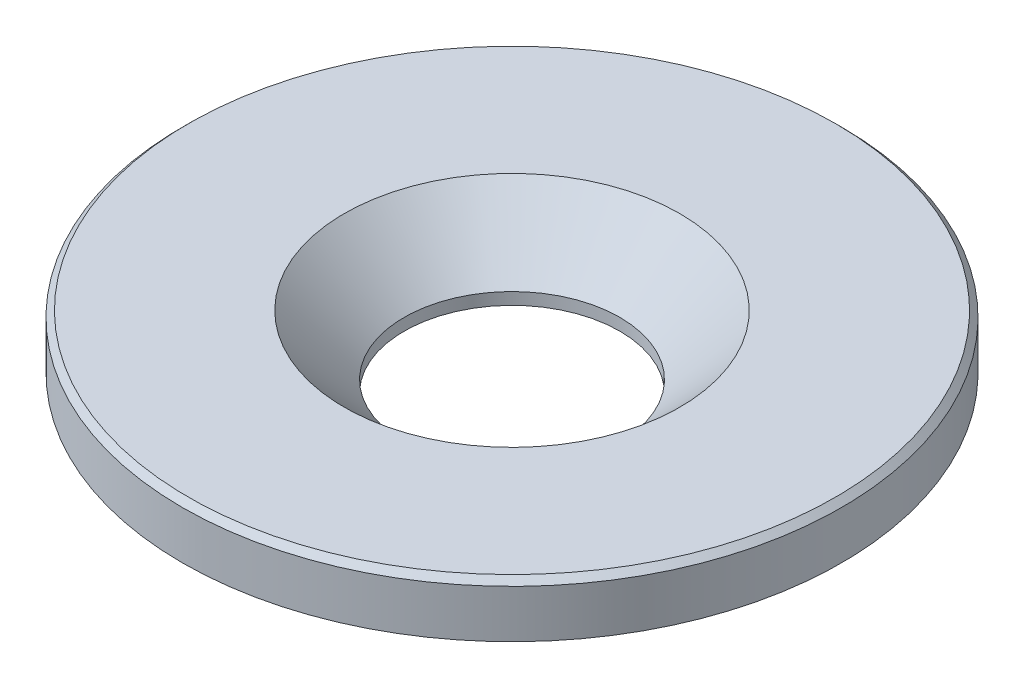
ISO-10303-21;
HEADER;
FILE_DESCRIPTION(('STEP AP214'),'2;1');
FILE_NAME('part.step','',(''),(''),'','','');
FILE_SCHEMA(('AUTOMOTIVE_DESIGN { 1 0 10303 214 1 1 1 1 }'));
ENDSEC;
DATA;
#1=APPLICATION_CONTEXT('core data for automotive mechanical design processes');
#2=APPLICATION_PROTOCOL_DEFINITION('international standard','automotive_design',2000,#1);
#3=PRODUCT_CONTEXT('',#1,'mechanical');
#4=PRODUCT('Part','Part','',(#3));
#5=PRODUCT_RELATED_PRODUCT_CATEGORY('part','',(#4));
#6=PRODUCT_DEFINITION_FORMATION('','',#4);
#7=PRODUCT_DEFINITION_CONTEXT('part definition',#1,'design');
#8=PRODUCT_DEFINITION('design','',#6,#7);
#9=PRODUCT_DEFINITION_SHAPE('','',#8);
#10=(LENGTH_UNIT() NAMED_UNIT(*) SI_UNIT(.MILLI.,.METRE.));
#11=(NAMED_UNIT(*) PLANE_ANGLE_UNIT() SI_UNIT($,.RADIAN.));
#12=(NAMED_UNIT(*) SI_UNIT($,.STERADIAN.) SOLID_ANGLE_UNIT());
#13=UNCERTAINTY_MEASURE_WITH_UNIT(LENGTH_MEASURE(1.E-05),#10,'distance_accuracy_value','');
#14=(GEOMETRIC_REPRESENTATION_CONTEXT(3) GLOBAL_UNCERTAINTY_ASSIGNED_CONTEXT((#13)) GLOBAL_UNIT_ASSIGNED_CONTEXT((#10,
#11,#12)) REPRESENTATION_CONTEXT('',''));
#15=CARTESIAN_POINT('',(0.,0.,0.));
#16=DIRECTION('',(0.,0.,1.));
#17=DIRECTION('',(1.,0.,0.));
#18=AXIS2_PLACEMENT_3D('',#15,#16,#17);
#19=CARTESIAN_POINT('',(0.,0.,0.));
#20=DIRECTION('',(0.,-1.,0.));
#21=DIRECTION('',(0.,0.,-1.));
#22=AXIS2_PLACEMENT_3D('',#19,#20,#21);
#23=CYLINDRICAL_SURFACE('',#22,18.);
#24=CARTESIAN_POINT('',(0.,2.,0.));
#25=DIRECTION('',(0.,-1.,0.));
#26=DIRECTION('',(0.,0.,-1.));
#27=AXIS2_PLACEMENT_3D('',#24,#25,#26);
#28=CIRCLE('',#27,18.);
#29=CARTESIAN_POINT('',(0.,2.,-18.));
#30=VERTEX_POINT('',#29);
#31=EDGE_CURVE('E34',#30,#30,#28,.T.);
#32=ORIENTED_EDGE('',*,*,#31,.F.);
#33=EDGE_LOOP('',(#32));
#34=FACE_BOUND('',#33,.T.);
#35=CARTESIAN_POINT('',(0.,0.,0.));
#36=DIRECTION('',(0.,-1.,0.));
#37=DIRECTION('',(0.,0.,-1.));
#38=AXIS2_PLACEMENT_3D('',#35,#36,#37);
#39=CIRCLE('',#38,18.);
#40=CARTESIAN_POINT('',(0.,0.,-18.));
#41=VERTEX_POINT('',#40);
#42=EDGE_CURVE('E46',#41,#41,#39,.T.);
#43=ORIENTED_EDGE('',*,*,#42,.T.);
#44=EDGE_LOOP('',(#43));
#45=FACE_BOUND('',#44,.T.);
#46=ADVANCED_FACE('F14',(#34,#45),#23,.F.);
#47=CARTESIAN_POINT('',(0.,2.,0.));
#48=DIRECTION('',(0.,1.,0.));
#49=DIRECTION('',(0.,0.,1.));
#50=AXIS2_PLACEMENT_3D('',#47,#48,#49);
#51=CONICAL_SURFACE('',#50,18.,0.78539816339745);
#52=CARTESIAN_POINT('',(0.,12.,0.));
#53=DIRECTION('',(0.,-1.,0.));
#54=DIRECTION('',(0.,0.,-1.));
#55=AXIS2_PLACEMENT_3D('',#52,#53,#54);
#56=CIRCLE('',#55,28.);
#57=CARTESIAN_POINT('',(0.,12.,-28.));
#58=VERTEX_POINT('',#57);
#59=EDGE_CURVE('E37',#58,#58,#56,.T.);
#60=ORIENTED_EDGE('',*,*,#59,.F.);
#61=EDGE_LOOP('',(#60));
#62=FACE_BOUND('',#61,.T.);
#63=ORIENTED_EDGE('',*,*,#31,.T.);
#64=EDGE_LOOP('',(#63));
#65=FACE_BOUND('',#64,.T.);
#66=ADVANCED_FACE('F68',(#62,#65),#51,.F.);
#67=CARTESIAN_POINT('',(-28.,12.,0.));
#68=DIRECTION('',(0.,-1.,0.));
#69=DIRECTION('',(0.,0.,-1.));
#70=AXIS2_PLACEMENT_3D('',#67,#68,#69);
#71=PLANE('',#70);
#72=CARTESIAN_POINT('',(0.,12.,0.));
#73=DIRECTION('',(0.,-1.,0.));
#74=DIRECTION('',(0.,0.,-1.));
#75=AXIS2_PLACEMENT_3D('',#72,#73,#74);
#76=CIRCLE('',#75,54.);
#77=CARTESIAN_POINT('',(0.,12.,-54.));
#78=VERTEX_POINT('',#77);
#79=EDGE_CURVE('E9',#78,#78,#76,.F.);
#80=ORIENTED_EDGE('',*,*,#79,.T.);
#81=EDGE_LOOP('',(#80));
#82=FACE_BOUND('',#81,.T.);
#83=ORIENTED_EDGE('',*,*,#59,.T.);
#84=EDGE_LOOP('',(#83));
#85=FACE_BOUND('',#84,.T.);
#86=ADVANCED_FACE('F75',(#82,#85),#71,.F.);
#87=CARTESIAN_POINT('',(0.,0.,0.));
#88=DIRECTION('',(0.,-1.,0.));
#89=DIRECTION('',(0.,0.,-1.));
#90=AXIS2_PLACEMENT_3D('',#87,#88,#89);
#91=CYLINDRICAL_SURFACE('',#90,55.);
#92=CARTESIAN_POINT('',(0.,11.,0.));
#93=DIRECTION('',(0.,-1.,0.));
#94=DIRECTION('',(0.,0.,-1.));
#95=AXIS2_PLACEMENT_3D('',#92,#93,#94);
#96=CIRCLE('',#95,55.);
#97=CARTESIAN_POINT('',(0.,11.,-55.));
#98=VERTEX_POINT('',#97);
#99=EDGE_CURVE('E21',#98,#98,#96,.T.);
#100=ORIENTED_EDGE('',*,*,#99,.T.);
#101=EDGE_LOOP('',(#100));
#102=FACE_BOUND('',#101,.T.);
#103=CARTESIAN_POINT('',(0.,3.,0.));
#104=DIRECTION('',(0.,-1.,0.));
#105=DIRECTION('',(0.,0.,-1.));
#106=AXIS2_PLACEMENT_3D('',#103,#104,#105);
#107=CIRCLE('',#106,55.);
#108=CARTESIAN_POINT('',(0.,3.,-55.));
#109=VERTEX_POINT('',#108);
#110=EDGE_CURVE('E40',#109,#109,#107,.T.);
#111=ORIENTED_EDGE('',*,*,#110,.F.);
#112=EDGE_LOOP('',(#111));
#113=FACE_BOUND('',#112,.T.);
#114=ADVANCED_FACE('F82',(#102,#113),#91,.T.);
#115=CARTESIAN_POINT('',(-45.,3.,0.));
#116=DIRECTION('',(0.,1.,0.));
#117=DIRECTION('',(0.,0.,1.));
#118=AXIS2_PLACEMENT_3D('',#115,#116,#117);
#119=PLANE('',#118);
#120=CARTESIAN_POINT('',(0.,3.,0.));
#121=DIRECTION('',(0.,-1.,0.));
#122=DIRECTION('',(0.,0.,-1.));
#123=AXIS2_PLACEMENT_3D('',#120,#121,#122);
#124=CIRCLE('',#123,45.);
#125=CARTESIAN_POINT('',(0.,3.,-45.));
#126=VERTEX_POINT('',#125);
#127=EDGE_CURVE('E43',#126,#126,#124,.T.);
#128=ORIENTED_EDGE('',*,*,#127,.F.);
#129=EDGE_LOOP('',(#128));
#130=FACE_BOUND('',#129,.T.);
#131=ORIENTED_EDGE('',*,*,#110,.T.);
#132=EDGE_LOOP('',(#131));
#133=FACE_BOUND('',#132,.T.);
#134=ADVANCED_FACE('F64',(#130,#133),#119,.F.);
#135=CARTESIAN_POINT('',(0.,0.,0.));
#136=DIRECTION('',(0.,-1.,0.));
#137=DIRECTION('',(0.,0.,-1.));
#138=AXIS2_PLACEMENT_3D('',#135,#136,#137);
#139=CYLINDRICAL_SURFACE('',#138,45.);
#140=CARTESIAN_POINT('',(0.,1.00000000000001,0.));
#141=DIRECTION('',(0.,1.,0.));
#142=DIRECTION('',(0.,0.,1.));
#143=AXIS2_PLACEMENT_3D('',#140,#141,#142);
#144=CIRCLE('',#143,45.);
#145=CARTESIAN_POINT('',(0.,1.00000000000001,45.));
#146=VERTEX_POINT('',#145);
#147=EDGE_CURVE('E25',#146,#146,#144,.T.);
#148=ORIENTED_EDGE('',*,*,#147,.T.);
#149=EDGE_LOOP('',(#148));
#150=FACE_BOUND('',#149,.T.);
#151=ORIENTED_EDGE('',*,*,#127,.T.);
#152=EDGE_LOOP('',(#151));
#153=FACE_BOUND('',#152,.T.);
#154=ADVANCED_FACE('F54',(#150,#153),#139,.T.);
#155=CARTESIAN_POINT('',(-18.,0.,0.));
#156=DIRECTION('',(0.,1.,0.));
#157=DIRECTION('',(0.,0.,1.));
#158=AXIS2_PLACEMENT_3D('',#155,#156,#157);
#159=PLANE('',#158);
#160=CARTESIAN_POINT('',(0.,0.,0.));
#161=DIRECTION('',(0.,1.,0.));
#162=DIRECTION('',(0.,0.,1.));
#163=AXIS2_PLACEMENT_3D('',#160,#161,#162);
#164=CIRCLE('',#163,44.);
#165=CARTESIAN_POINT('',(0.,0.,44.));
#166=VERTEX_POINT('',#165);
#167=EDGE_CURVE('E29',#166,#166,#164,.F.);
#168=ORIENTED_EDGE('',*,*,#167,.T.);
#169=EDGE_LOOP('',(#168));
#170=FACE_BOUND('',#169,.T.);
#171=ORIENTED_EDGE('',*,*,#42,.F.);
#172=EDGE_LOOP('',(#171));
#173=FACE_BOUND('',#172,.T.);
#174=ADVANCED_FACE('F51',(#170,#173),#159,.F.);
#175=CARTESIAN_POINT('',(0.,0.,0.));
#176=DIRECTION('',(0.,1.,0.));
#177=DIRECTION('',(0.,0.,1.));
#178=AXIS2_PLACEMENT_3D('',#175,#176,#177);
#179=CONICAL_SURFACE('',#178,44.,0.785398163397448);
#180=ORIENTED_EDGE('',*,*,#147,.F.);
#181=EDGE_LOOP('',(#180));
#182=FACE_BOUND('',#181,.T.);
#183=ORIENTED_EDGE('',*,*,#167,.F.);
#184=EDGE_LOOP('',(#183));
#185=FACE_BOUND('',#184,.T.);
#186=ADVANCED_FACE('F53',(#182,#185),#179,.T.);
#187=CARTESIAN_POINT('',(0.,11.,0.));
#188=DIRECTION('',(0.,-1.,0.));
#189=DIRECTION('',(0.,0.,-1.));
#190=AXIS2_PLACEMENT_3D('',#187,#188,#189);
#191=CONICAL_SURFACE('',#190,55.,0.785398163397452);
#192=ORIENTED_EDGE('',*,*,#79,.F.);
#193=EDGE_LOOP('',(#192));
#194=FACE_BOUND('',#193,.T.);
#195=ORIENTED_EDGE('',*,*,#99,.F.);
#196=EDGE_LOOP('',(#195));
#197=FACE_BOUND('',#196,.T.);
#198=ADVANCED_FACE('F16',(#194,#197),#191,.T.);
#199=CLOSED_SHELL('',(#46,#66,#86,#114,#134,#154,#174,#186,#198));
#200=MANIFOLD_SOLID_BREP('B1',#199);
#201=ADVANCED_BREP_SHAPE_REPRESENTATION('',(#18,#200),#14);
#202=SHAPE_DEFINITION_REPRESENTATION(#9,#201);
ENDSEC;
END-ISO-10303-21;
